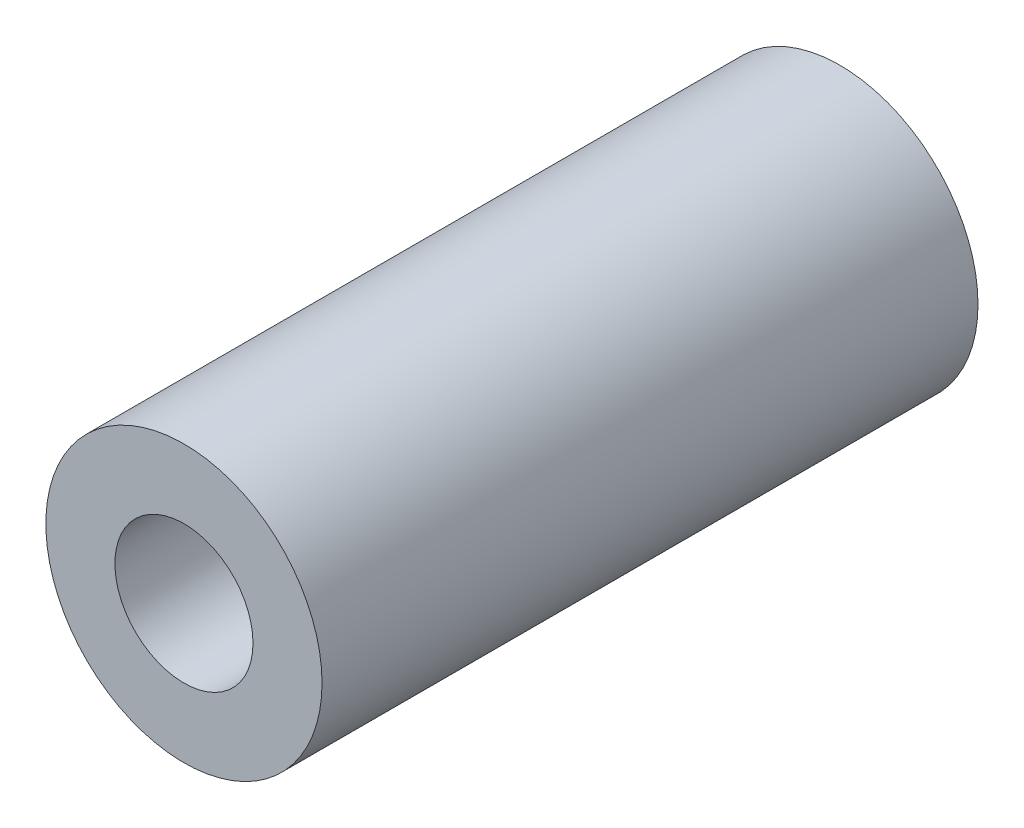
from build123d import *

# Parameters (mm, degrees)
SKETCH_1_R      = 2
SKETCH_1_R_2    = 1
EXTRUDE_1_DEPTH = 9.5


with BuildPart() as part:
    # Sketch 1 → Extrude 1 (new body)
    with BuildSketch(Plane.XY):
        Circle(SKETCH_1_R)
        Circle(SKETCH_1_R_2, mode=Mode.SUBTRACT)
    extrude(amount=EXTRUDE_1_DEPTH)


solid = part.part
